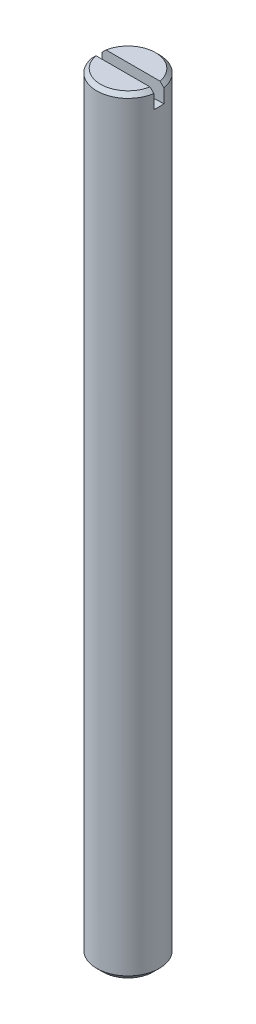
ISO-10303-21;
HEADER;
FILE_DESCRIPTION(('STEP AP214'),'2;1');
FILE_NAME('part.step','',(''),(''),'','','');
FILE_SCHEMA(('AUTOMOTIVE_DESIGN { 1 0 10303 214 1 1 1 1 }'));
ENDSEC;
DATA;
#1=APPLICATION_CONTEXT('core data for automotive mechanical design processes');
#2=APPLICATION_PROTOCOL_DEFINITION('international standard','automotive_design',2000,#1);
#3=PRODUCT_CONTEXT('',#1,'mechanical');
#4=PRODUCT('Part','Part','',(#3));
#5=PRODUCT_RELATED_PRODUCT_CATEGORY('part','',(#4));
#6=PRODUCT_DEFINITION_FORMATION('','',#4);
#7=PRODUCT_DEFINITION_CONTEXT('part definition',#1,'design');
#8=PRODUCT_DEFINITION('design','',#6,#7);
#9=PRODUCT_DEFINITION_SHAPE('','',#8);
#10=(LENGTH_UNIT() NAMED_UNIT(*) SI_UNIT(.MILLI.,.METRE.));
#11=(NAMED_UNIT(*) PLANE_ANGLE_UNIT() SI_UNIT($,.RADIAN.));
#12=(NAMED_UNIT(*) SI_UNIT($,.STERADIAN.) SOLID_ANGLE_UNIT());
#13=UNCERTAINTY_MEASURE_WITH_UNIT(LENGTH_MEASURE(1.E-05),#10,'distance_accuracy_value','');
#14=(GEOMETRIC_REPRESENTATION_CONTEXT(3) GLOBAL_UNCERTAINTY_ASSIGNED_CONTEXT((#13)) GLOBAL_UNIT_ASSIGNED_CONTEXT((#10,
#11,#12)) REPRESENTATION_CONTEXT('',''));
#15=CARTESIAN_POINT('',(0.,0.,0.));
#16=DIRECTION('',(0.,0.,1.));
#17=DIRECTION('',(1.,0.,0.));
#18=AXIS2_PLACEMENT_3D('',#15,#16,#17);
#19=CARTESIAN_POINT('',(0.,41.5,0.));
#20=DIRECTION('',(0.,-1.,0.));
#21=DIRECTION('',(0.,0.,-1.));
#22=AXIS2_PLACEMENT_3D('',#19,#20,#21);
#23=PLANE('',#22);
#24=CARTESIAN_POINT('',(0.,41.499999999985,0.));
#25=DIRECTION('',(0.,-1.,0.));
#26=DIRECTION('',(0.,0.,-1.));
#27=AXIS2_PLACEMENT_3D('',#24,#25,#26);
#28=CIRCLE('',#27,2.19349999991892);
#29=CARTESIAN_POINT('',(-2.1567202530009,41.4999999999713,-0.4));
#30=VERTEX_POINT('',#29);
#31=CARTESIAN_POINT('',(2.1567202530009,41.4999999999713,-0.4));
#32=VERTEX_POINT('',#31);
#33=EDGE_CURVE('E165',#30,#32,#28,.T.);
#34=ORIENTED_EDGE('',*,*,#33,.F.);
#35=DIRECTION('',(1.,0.,0.));
#36=VECTOR('',#35,1.);
#37=CARTESIAN_POINT('',(0.,41.5,-0.4));
#38=LINE('',#37,#36);
#39=EDGE_CURVE('E163',#32,#30,#38,.F.);
#40=ORIENTED_EDGE('',*,*,#39,.F.);
#41=EDGE_LOOP('',(#34,#40));
#42=FACE_BOUND('',#41,.T.);
#43=ADVANCED_FACE('F14',(#42),#23,.F.);
#44=CARTESIAN_POINT('',(0.,41.5,0.));
#45=DIRECTION('',(0.,-1.,0.));
#46=DIRECTION('',(0.,0.,-1.));
#47=AXIS2_PLACEMENT_3D('',#44,#45,#46);
#48=PLANE('',#47);
#49=DIRECTION('',(1.,0.,0.));
#50=VECTOR('',#49,1.);
#51=CARTESIAN_POINT('',(0.,41.5,0.4));
#52=LINE('',#51,#50);
#53=CARTESIAN_POINT('',(-2.1567202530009,41.4999999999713,0.4));
#54=VERTEX_POINT('',#53);
#55=CARTESIAN_POINT('',(2.1567202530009,41.4999999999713,0.4));
#56=VERTEX_POINT('',#55);
#57=EDGE_CURVE('E161',#54,#56,#52,.T.);
#58=ORIENTED_EDGE('',*,*,#57,.F.);
#59=CARTESIAN_POINT('',(0.,41.499999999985,0.));
#60=DIRECTION('',(0.,-1.,0.));
#61=DIRECTION('',(0.,0.,-1.));
#62=AXIS2_PLACEMENT_3D('',#59,#60,#61);
#63=CIRCLE('',#62,2.19349999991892);
#64=EDGE_CURVE('E159',#56,#54,#63,.T.);
#65=ORIENTED_EDGE('',*,*,#64,.F.);
#66=EDGE_LOOP('',(#58,#65));
#67=FACE_BOUND('',#66,.T.);
#68=ADVANCED_FACE('F121',(#67),#48,.F.);
#69=CARTESIAN_POINT('',(0.,41.1934999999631,0.));
#70=DIRECTION('',(0.,-1.,0.));
#71=DIRECTION('',(0.,0.,-1.));
#72=AXIS2_PLACEMENT_3D('',#69,#70,#71);
#73=CONICAL_SURFACE('',#72,2.49999999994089,0.785398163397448);
#74=CARTESIAN_POINT('',(-2.15672025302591,41.4999999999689,-0.400000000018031));
#75=CARTESIAN_POINT('',(-2.20861576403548,41.4489675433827,-0.400000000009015));
#76=CARTESIAN_POINT('',(-2.26048621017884,41.3979096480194,-0.400000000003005));
#77=CARTESIAN_POINT('',(-2.36417697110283,41.2957429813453,-0.399999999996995));
#78=CARTESIAN_POINT('',(-2.41599728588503,41.244634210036,-0.399999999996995));
#79=CARTESIAN_POINT('',(-2.4677925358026,41.1934999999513,-0.4));
#80=B_SPLINE_CURVE_WITH_KNOTS('',3,(#74,#75,#76,#77,#78,#79),.UNSPECIFIED.,.F.,.F.,(4,2,4),(0.,
0.218350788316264,0.436701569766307),.UNSPECIFIED.);
#81=CARTESIAN_POINT('',(-2.46779253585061,41.1934999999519,-0.4));
#82=VERTEX_POINT('',#81);
#83=EDGE_CURVE('E39',#30,#82,#80,.T.);
#84=ORIENTED_EDGE('',*,*,#83,.F.);
#85=ORIENTED_EDGE('',*,*,#33,.T.);
#86=CARTESIAN_POINT('',(2.46779253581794,41.1934999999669,-0.400000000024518));
#87=CARTESIAN_POINT('',(2.41599728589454,41.2446342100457,-0.400000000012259));
#88=CARTESIAN_POINT('',(2.36417697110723,41.2957429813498,-0.400000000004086));
#89=CARTESIAN_POINT('',(2.26048621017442,41.3979096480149,-0.399999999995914));
#90=CARTESIAN_POINT('',(2.20861576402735,41.4489675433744,-0.399999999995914));
#91=CARTESIAN_POINT('',(2.15672025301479,41.4999999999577,-0.4));
#92=B_SPLINE_CURVE_WITH_KNOTS('',3,(#86,#87,#88,#89,#90,#91),.UNSPECIFIED.,.F.,.F.,(4,2,4),(0.,
0.218350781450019,0.436701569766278),.UNSPECIFIED.);
#93=CARTESIAN_POINT('',(2.46779253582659,41.1934999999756,-0.4));
#94=VERTEX_POINT('',#93);
#95=EDGE_CURVE('E134',#94,#32,#92,.T.);
#96=ORIENTED_EDGE('',*,*,#95,.F.);
#97=CARTESIAN_POINT('',(0.,41.1935,0.));
#98=DIRECTION('',(0.,-1.,0.));
#99=DIRECTION('',(0.,0.,-1.));
#100=AXIS2_PLACEMENT_3D('',#97,#98,#99);
#101=CIRCLE('',#100,2.5);
#102=EDGE_CURVE('E9',#82,#94,#101,.T.);
#103=ORIENTED_EDGE('',*,*,#102,.F.);
#104=EDGE_LOOP('',(#84,#85,#96,#103));
#105=FACE_BOUND('',#104,.T.);
#106=ADVANCED_FACE('F116',(#105),#73,.T.);
#107=CARTESIAN_POINT('',(0.,71.5,-0.4));
#108=DIRECTION('',(0.,0.,1.));
#109=DIRECTION('',(1.,0.,0.));
#110=AXIS2_PLACEMENT_3D('',#107,#108,#109);
#111=PLANE('',#110);
#112=ORIENTED_EDGE('',*,*,#39,.T.);
#113=ORIENTED_EDGE('',*,*,#83,.T.);
#114=DIRECTION('',(0.,1.,0.));
#115=VECTOR('',#114,1.);
#116=CARTESIAN_POINT('',(-2.46779253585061,71.5,-0.4));
#117=LINE('',#116,#115);
#118=CARTESIAN_POINT('',(-2.46779253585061,40.096815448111,-0.4));
#119=VERTEX_POINT('',#118);
#120=EDGE_CURVE('E154',#82,#119,#117,.F.);
#121=ORIENTED_EDGE('',*,*,#120,.T.);
#122=CARTESIAN_POINT('',(0.,71.5,-0.4));
#123=DIRECTION('',(0.,0.,-1.));
#124=DIRECTION('',(-1.,0.,0.));
#125=AXIS2_PLACEMENT_3D('',#122,#123,#124);
#126=CIRCLE('',#125,31.5);
#127=CARTESIAN_POINT('',(2.46779253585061,40.096815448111,-0.4));
#128=VERTEX_POINT('',#127);
#129=EDGE_CURVE('E88',#119,#128,#126,.F.);
#130=ORIENTED_EDGE('',*,*,#129,.T.);
#131=DIRECTION('',(0.,1.,0.));
#132=VECTOR('',#131,1.);
#133=CARTESIAN_POINT('',(2.46779253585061,71.5,-0.4));
#134=LINE('',#133,#132);
#135=EDGE_CURVE('E140',#128,#94,#134,.T.);
#136=ORIENTED_EDGE('',*,*,#135,.T.);
#137=ORIENTED_EDGE('',*,*,#95,.T.);
#138=EDGE_LOOP('',(#112,#113,#121,#130,#136,#137));
#139=FACE_BOUND('',#138,.T.);
#140=ADVANCED_FACE('F120',(#139),#111,.T.);
#141=CARTESIAN_POINT('',(0.,41.1934999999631,0.));
#142=DIRECTION('',(0.,-1.,0.));
#143=DIRECTION('',(0.,0.,-1.));
#144=AXIS2_PLACEMENT_3D('',#141,#142,#143);
#145=CONICAL_SURFACE('',#144,2.49999999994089,0.785398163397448);
#146=ORIENTED_EDGE('',*,*,#64,.T.);
#147=CARTESIAN_POINT('',(-2.15672025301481,41.4999999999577,0.4));
#148=CARTESIAN_POINT('',(-2.20861576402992,41.448967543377,0.4));
#149=CARTESIAN_POINT('',(-2.26048621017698,41.3979096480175,0.4));
#150=CARTESIAN_POINT('',(-2.36417697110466,41.2957429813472,0.4));
#151=CARTESIAN_POINT('',(-2.41599728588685,41.2446342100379,0.4));
#152=CARTESIAN_POINT('',(-2.46779253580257,41.1934999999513,0.4));
#153=B_SPLINE_CURVE_WITH_KNOTS('',3,(#147,#148,#149,#150,#151,#152),.UNSPECIFIED.,.F.,.F.,(4,2,
4),(0.,0.218350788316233,0.436701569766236),.UNSPECIFIED.);
#154=CARTESIAN_POINT('',(-2.46779253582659,41.1934999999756,0.4));
#155=VERTEX_POINT('',#154);
#156=EDGE_CURVE('E149',#54,#155,#153,.T.);
#157=ORIENTED_EDGE('',*,*,#156,.T.);
#158=CARTESIAN_POINT('',(0.,41.1935,0.));
#159=DIRECTION('',(0.,-1.,0.));
#160=DIRECTION('',(0.,0.,-1.));
#161=AXIS2_PLACEMENT_3D('',#158,#159,#160);
#162=CIRCLE('',#161,2.5);
#163=CARTESIAN_POINT('',(2.46779253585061,41.1934999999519,0.4));
#164=VERTEX_POINT('',#163);
#165=EDGE_CURVE('E30',#164,#155,#162,.T.);
#166=ORIENTED_EDGE('',*,*,#165,.F.);
#167=CARTESIAN_POINT('',(2.46779253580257,41.1934999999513,0.4));
#168=CARTESIAN_POINT('',(2.41599728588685,41.2446342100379,0.4));
#169=CARTESIAN_POINT('',(2.36417697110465,41.2957429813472,0.4));
#170=CARTESIAN_POINT('',(2.26048621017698,41.3979096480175,0.4));
#171=CARTESIAN_POINT('',(2.20861576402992,41.448967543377,0.4));
#172=CARTESIAN_POINT('',(2.15672025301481,41.4999999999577,0.4));
#173=B_SPLINE_CURVE_WITH_KNOTS('',3,(#167,#168,#169,#170,#171,#172),.UNSPECIFIED.,.F.,.F.,(4,2,
4),(0.,0.21835078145,0.436701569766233),.UNSPECIFIED.);
#174=EDGE_CURVE('E96',#164,#56,#173,.T.);
#175=ORIENTED_EDGE('',*,*,#174,.T.);
#176=EDGE_LOOP('',(#146,#157,#166,#175));
#177=FACE_BOUND('',#176,.T.);
#178=ADVANCED_FACE('F122',(#177),#145,.T.);
#179=CARTESIAN_POINT('',(0.,71.5,0.4));
#180=DIRECTION('',(0.,0.,1.));
#181=DIRECTION('',(1.,0.,0.));
#182=AXIS2_PLACEMENT_3D('',#179,#180,#181);
#183=PLANE('',#182);
#184=ORIENTED_EDGE('',*,*,#57,.T.);
#185=ORIENTED_EDGE('',*,*,#174,.F.);
#186=DIRECTION('',(0.,1.,0.));
#187=VECTOR('',#186,1.);
#188=CARTESIAN_POINT('',(2.46779253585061,71.5,0.4));
#189=LINE('',#188,#187);
#190=CARTESIAN_POINT('',(2.46779253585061,40.096815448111,0.4));
#191=VERTEX_POINT('',#190);
#192=EDGE_CURVE('E94',#191,#164,#189,.T.);
#193=ORIENTED_EDGE('',*,*,#192,.F.);
#194=CARTESIAN_POINT('',(0.,71.5,0.4));
#195=DIRECTION('',(0.,0.,-1.));
#196=DIRECTION('',(-1.,0.,0.));
#197=AXIS2_PLACEMENT_3D('',#194,#195,#196);
#198=CIRCLE('',#197,31.5);
#199=CARTESIAN_POINT('',(-2.46779253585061,40.096815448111,0.4));
#200=VERTEX_POINT('',#199);
#201=EDGE_CURVE('E81',#200,#191,#198,.F.);
#202=ORIENTED_EDGE('',*,*,#201,.F.);
#203=DIRECTION('',(0.,1.,0.));
#204=VECTOR('',#203,1.);
#205=CARTESIAN_POINT('',(-2.46779253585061,71.5,0.4));
#206=LINE('',#205,#204);
#207=EDGE_CURVE('E73',#155,#200,#206,.F.);
#208=ORIENTED_EDGE('',*,*,#207,.F.);
#209=ORIENTED_EDGE('',*,*,#156,.F.);
#210=EDGE_LOOP('',(#184,#185,#193,#202,#208,#209));
#211=FACE_BOUND('',#210,.T.);
#212=ADVANCED_FACE('F92',(#211),#183,.F.);
#213=CARTESIAN_POINT('',(0.,71.5,0.4));
#214=DIRECTION('',(0.,0.,-1.));
#215=DIRECTION('',(-1.,0.,0.));
#216=AXIS2_PLACEMENT_3D('',#213,#214,#215);
#217=CYLINDRICAL_SURFACE('',#216,31.5);
#218=CARTESIAN_POINT('',(2.46779253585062,40.096815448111,-0.4));
#219=CARTESIAN_POINT('',(2.47854531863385,40.0976618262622,-0.333698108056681));
#220=CARTESIAN_POINT('',(2.48661458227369,40.098300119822,-0.266959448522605));
#221=CARTESIAN_POINT('',(2.49732458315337,40.0991493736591,-0.133478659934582));
#222=CARTESIAN_POINT('',(2.5,40.0993630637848,-0.066739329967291));
#223=CARTESIAN_POINT('',(2.5,40.0993630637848,0.066739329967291));
#224=CARTESIAN_POINT('',(2.49732458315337,40.0991493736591,0.133478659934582));
#225=CARTESIAN_POINT('',(2.48661458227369,40.098300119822,0.266959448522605));
#226=CARTESIAN_POINT('',(2.47854531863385,40.0976618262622,0.333698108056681));
#227=CARTESIAN_POINT('',(2.46779253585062,40.096815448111,0.4));
#228=B_SPLINE_CURVE_WITH_KNOTS('',3,(#218,#219,#220,#221,#222,#223,#224,#225,#226,#227),
.UNSPECIFIED.,.F.,.F.,(4,2,2,2,4),(0.,0.201464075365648,0.401628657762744,0.601793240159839,
0.803257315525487),.UNSPECIFIED.);
#229=EDGE_CURVE('E82',#128,#191,#228,.T.);
#230=ORIENTED_EDGE('',*,*,#229,.F.);
#231=ORIENTED_EDGE('',*,*,#129,.F.);
#232=CARTESIAN_POINT('',(-2.46779253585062,40.096815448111,0.4));
#233=CARTESIAN_POINT('',(-2.47854531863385,40.0976618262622,0.333698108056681));
#234=CARTESIAN_POINT('',(-2.48661458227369,40.098300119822,0.266959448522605));
#235=CARTESIAN_POINT('',(-2.49732458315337,40.0991493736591,0.133478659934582));
#236=CARTESIAN_POINT('',(-2.5,40.0993630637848,0.066739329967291));
#237=CARTESIAN_POINT('',(-2.5,40.0993630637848,-0.066739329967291));
#238=CARTESIAN_POINT('',(-2.49732458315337,40.0991493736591,-0.133478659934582));
#239=CARTESIAN_POINT('',(-2.48661458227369,40.098300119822,-0.266959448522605));
#240=CARTESIAN_POINT('',(-2.47854531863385,40.0976618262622,-0.333698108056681));
#241=CARTESIAN_POINT('',(-2.46779253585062,40.096815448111,-0.4));
#242=B_SPLINE_CURVE_WITH_KNOTS('',3,(#232,#233,#234,#235,#236,#237,#238,#239,#240,#241),
.UNSPECIFIED.,.F.,.F.,(4,2,2,2,4),(0.,0.201464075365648,0.401628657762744,0.601793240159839,
0.803257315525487),.UNSPECIFIED.);
#243=EDGE_CURVE('E19',#200,#119,#242,.T.);
#244=ORIENTED_EDGE('',*,*,#243,.F.);
#245=ORIENTED_EDGE('',*,*,#201,.T.);
#246=EDGE_LOOP('',(#230,#231,#244,#245));
#247=FACE_BOUND('',#246,.T.);
#248=ADVANCED_FACE('F16',(#247),#217,.F.);
#249=CARTESIAN_POINT('',(0.,30.,0.));
#250=DIRECTION('',(0.,-1.,0.));
#251=DIRECTION('',(0.,0.,-1.));
#252=AXIS2_PLACEMENT_3D('',#249,#250,#251);
#253=CYLINDRICAL_SURFACE('',#252,2.5);
#254=ORIENTED_EDGE('',*,*,#229,.T.);
#255=ORIENTED_EDGE('',*,*,#192,.T.);
#256=ORIENTED_EDGE('',*,*,#165,.T.);
#257=ORIENTED_EDGE('',*,*,#207,.T.);
#258=ORIENTED_EDGE('',*,*,#243,.T.);
#259=ORIENTED_EDGE('',*,*,#120,.F.);
#260=ORIENTED_EDGE('',*,*,#102,.T.);
#261=ORIENTED_EDGE('',*,*,#135,.F.);
#262=EDGE_LOOP('',(#254,#255,#256,#257,#258,#259,#260,#261));
#263=FACE_BOUND('',#262,.T.);
#264=CARTESIAN_POINT('',(0.,-19.5095,0.));
#265=DIRECTION('',(0.,-1.,0.));
#266=DIRECTION('',(0.,0.,-1.));
#267=AXIS2_PLACEMENT_3D('',#264,#265,#266);
#268=CIRCLE('',#267,2.5);
#269=CARTESIAN_POINT('',(0.,-19.5095,-2.5));
#270=VERTEX_POINT('',#269);
#271=EDGE_CURVE('E172',#270,#270,#268,.F.);
#272=ORIENTED_EDGE('',*,*,#271,.T.);
#273=EDGE_LOOP('',(#272));
#274=FACE_BOUND('',#273,.T.);
#275=ADVANCED_FACE('F75',(#263,#274),#253,.T.);
#276=CARTESIAN_POINT('',(2.0095,-20.,0.));
#277=DIRECTION('',(0.,1.,0.));
#278=DIRECTION('',(0.,0.,1.));
#279=AXIS2_PLACEMENT_3D('',#276,#277,#278);
#280=PLANE('',#279);
#281=CARTESIAN_POINT('',(0.,-20.0000000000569,0.));
#282=DIRECTION('',(0.,1.,0.));
#283=DIRECTION('',(0.,0.,1.));
#284=AXIS2_PLACEMENT_3D('',#281,#282,#283);
#285=CIRCLE('',#284,2.00949999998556);
#286=CARTESIAN_POINT('',(0.,-20.0000000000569,2.00949999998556));
#287=VERTEX_POINT('',#286);
#288=EDGE_CURVE('E90',#287,#287,#285,.T.);
#289=ORIENTED_EDGE('',*,*,#288,.F.);
#290=EDGE_LOOP('',(#289));
#291=FACE_BOUND('',#290,.T.);
#292=ADVANCED_FACE('F113',(#291),#280,.F.);
#293=CARTESIAN_POINT('',(0.,-19.5094999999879,0.));
#294=DIRECTION('',(0.,1.,0.));
#295=DIRECTION('',(0.,0.,1.));
#296=AXIS2_PLACEMENT_3D('',#293,#294,#295);
#297=CONICAL_SURFACE('',#296,2.50000000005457,0.785398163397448);
#298=ORIENTED_EDGE('',*,*,#271,.F.);
#299=EDGE_LOOP('',(#298));
#300=FACE_BOUND('',#299,.T.);
#301=ORIENTED_EDGE('',*,*,#288,.T.);
#302=EDGE_LOOP('',(#301));
#303=FACE_BOUND('',#302,.T.);
#304=ADVANCED_FACE('F114',(#300,#303),#297,.T.);
#305=CLOSED_SHELL('',(#43,#68,#106,#140,#178,#212,#248,#275,#292,#304));
#306=MANIFOLD_SOLID_BREP('B1',#305);
#307=ADVANCED_BREP_SHAPE_REPRESENTATION('',(#18,#306),#14);
#308=SHAPE_DEFINITION_REPRESENTATION(#9,#307);
ENDSEC;
END-ISO-10303-21;
